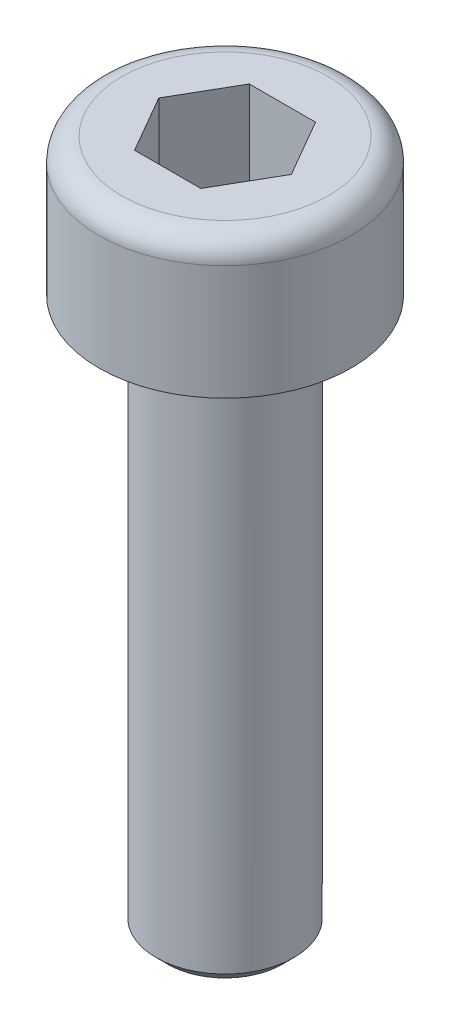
ISO-10303-21;
HEADER;
FILE_DESCRIPTION(('STEP AP214'),'2;1');
FILE_NAME('part.step','',(''),(''),'','','');
FILE_SCHEMA(('AUTOMOTIVE_DESIGN { 1 0 10303 214 1 1 1 1 }'));
ENDSEC;
DATA;
#1=APPLICATION_CONTEXT('core data for automotive mechanical design processes');
#2=APPLICATION_PROTOCOL_DEFINITION('international standard','automotive_design',2000,#1);
#3=PRODUCT_CONTEXT('',#1,'mechanical');
#4=PRODUCT('Part','Part','',(#3));
#5=PRODUCT_RELATED_PRODUCT_CATEGORY('part','',(#4));
#6=PRODUCT_DEFINITION_FORMATION('','',#4);
#7=PRODUCT_DEFINITION_CONTEXT('part definition',#1,'design');
#8=PRODUCT_DEFINITION('design','',#6,#7);
#9=PRODUCT_DEFINITION_SHAPE('','',#8);
#10=(LENGTH_UNIT() NAMED_UNIT(*) SI_UNIT(.MILLI.,.METRE.));
#11=(NAMED_UNIT(*) PLANE_ANGLE_UNIT() SI_UNIT($,.RADIAN.));
#12=(NAMED_UNIT(*) SI_UNIT($,.STERADIAN.) SOLID_ANGLE_UNIT());
#13=UNCERTAINTY_MEASURE_WITH_UNIT(LENGTH_MEASURE(1.E-05),#10,'distance_accuracy_value','');
#14=(GEOMETRIC_REPRESENTATION_CONTEXT(3) GLOBAL_UNCERTAINTY_ASSIGNED_CONTEXT((#13)) GLOBAL_UNIT_ASSIGNED_CONTEXT((#10,
#11,#12)) REPRESENTATION_CONTEXT('',''));
#15=CARTESIAN_POINT('',(0.,0.,0.));
#16=DIRECTION('',(0.,0.,1.));
#17=DIRECTION('',(1.,0.,0.));
#18=AXIS2_PLACEMENT_3D('',#15,#16,#17);
#19=CARTESIAN_POINT('',(0.,15.,0.));
#20=DIRECTION('',(0.,1.,0.));
#21=DIRECTION('',(0.,0.,1.));
#22=AXIS2_PLACEMENT_3D('',#19,#20,#21);
#23=PLANE('',#22);
#24=CARTESIAN_POINT('',(0.,15.,0.));
#25=DIRECTION('',(0.,1.,0.));
#26=DIRECTION('',(0.,0.,1.));
#27=AXIS2_PLACEMENT_3D('',#24,#25,#26);
#28=CIRCLE('',#27,2.25);
#29=CARTESIAN_POINT('',(0.,15.,2.25));
#30=VERTEX_POINT('',#29);
#31=EDGE_CURVE('E97',#30,#30,#28,.T.);
#32=ORIENTED_EDGE('',*,*,#31,.T.);
#33=EDGE_LOOP('',(#32));
#34=FACE_BOUND('',#33,.T.);
#35=DIRECTION('',(0.500000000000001,0.,-0.866025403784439));
#36=VECTOR('',#35,1.);
#37=CARTESIAN_POINT('',(-1.44337567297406,15.,0.));
#38=LINE('',#37,#36);
#39=CARTESIAN_POINT('',(-1.44337567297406,15.,0.));
#40=VERTEX_POINT('',#39);
#41=CARTESIAN_POINT('',(-0.721687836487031,15.,-1.24999999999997));
#42=VERTEX_POINT('',#41);
#43=EDGE_CURVE('E102',#40,#42,#38,.T.);
#44=ORIENTED_EDGE('',*,*,#43,.T.);
#45=DIRECTION('',(1.,0.,0.));
#46=VECTOR('',#45,1.);
#47=CARTESIAN_POINT('',(-0.721687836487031,15.,-1.24999999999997));
#48=LINE('',#47,#46);
#49=CARTESIAN_POINT('',(0.721687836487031,15.,-1.24999999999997));
#50=VERTEX_POINT('',#49);
#51=EDGE_CURVE('E43',#42,#50,#48,.T.);
#52=ORIENTED_EDGE('',*,*,#51,.T.);
#53=DIRECTION('',(0.5,0.,0.866025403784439));
#54=VECTOR('',#53,1.);
#55=CARTESIAN_POINT('',(0.721687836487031,15.,-1.24999999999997));
#56=LINE('',#55,#54);
#57=CARTESIAN_POINT('',(1.44337567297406,15.,0.));
#58=VERTEX_POINT('',#57);
#59=EDGE_CURVE('E83',#50,#58,#56,.T.);
#60=ORIENTED_EDGE('',*,*,#59,.T.);
#61=DIRECTION('',(-0.500000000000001,0.,0.866025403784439));
#62=VECTOR('',#61,1.);
#63=CARTESIAN_POINT('',(1.44337567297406,15.,0.));
#64=LINE('',#63,#62);
#65=CARTESIAN_POINT('',(0.721687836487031,15.,1.24999999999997));
#66=VERTEX_POINT('',#65);
#67=EDGE_CURVE('E91',#58,#66,#64,.T.);
#68=ORIENTED_EDGE('',*,*,#67,.T.);
#69=DIRECTION('',(-1.,0.,0.));
#70=VECTOR('',#69,1.);
#71=CARTESIAN_POINT('',(0.721687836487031,15.,1.24999999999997));
#72=LINE('',#71,#70);
#73=CARTESIAN_POINT('',(-0.721687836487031,15.,1.24999999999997));
#74=VERTEX_POINT('',#73);
#75=EDGE_CURVE('E106',#66,#74,#72,.T.);
#76=ORIENTED_EDGE('',*,*,#75,.T.);
#77=DIRECTION('',(-0.5,0.,-0.866025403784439));
#78=VECTOR('',#77,1.);
#79=CARTESIAN_POINT('',(-0.721687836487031,15.,1.24999999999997));
#80=LINE('',#79,#78);
#81=EDGE_CURVE('E109',#74,#40,#80,.T.);
#82=ORIENTED_EDGE('',*,*,#81,.T.);
#83=EDGE_LOOP('',(#44,#52,#60,#68,#76,#82));
#84=FACE_BOUND('',#83,.T.);
#85=ADVANCED_FACE('F28',(#34,#84),#23,.T.);
#86=CARTESIAN_POINT('',(-1.49999999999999,0.,0.));
#87=DIRECTION('',(0.,-1.,0.));
#88=DIRECTION('',(0.,0.,-1.));
#89=AXIS2_PLACEMENT_3D('',#86,#87,#88);
#90=PLANE('',#89);
#91=CARTESIAN_POINT('',(0.,0.,0.));
#92=DIRECTION('',(0.,-1.,0.));
#93=DIRECTION('',(0.,0.,-1.));
#94=AXIS2_PLACEMENT_3D('',#91,#92,#93);
#95=CIRCLE('',#94,1.24999999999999);
#96=CARTESIAN_POINT('',(0.,0.,-1.24999999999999));
#97=VERTEX_POINT('',#96);
#98=EDGE_CURVE('E11',#97,#97,#95,.T.);
#99=ORIENTED_EDGE('',*,*,#98,.T.);
#100=EDGE_LOOP('',(#99));
#101=FACE_BOUND('',#100,.T.);
#102=ADVANCED_FACE('F30',(#101),#90,.T.);
#103=CARTESIAN_POINT('',(0.,16.0880484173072,0.));
#104=DIRECTION('',(0.,1.,0.));
#105=DIRECTION('',(0.,0.,1.));
#106=AXIS2_PLACEMENT_3D('',#103,#104,#105);
#107=CYLINDRICAL_SURFACE('',#106,1.49999999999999);
#108=CARTESIAN_POINT('',(0.,0.25,0.));
#109=DIRECTION('',(0.,-1.,0.));
#110=DIRECTION('',(0.,0.,-1.));
#111=AXIS2_PLACEMENT_3D('',#108,#109,#110);
#112=CIRCLE('',#111,1.49999999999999);
#113=CARTESIAN_POINT('',(0.,0.25,-1.49999999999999));
#114=VERTEX_POINT('',#113);
#115=EDGE_CURVE('E36',#114,#114,#112,.F.);
#116=ORIENTED_EDGE('',*,*,#115,.T.);
#117=EDGE_LOOP('',(#116));
#118=FACE_BOUND('',#117,.T.);
#119=CARTESIAN_POINT('',(0.,12.,0.));
#120=DIRECTION('',(0.,1.,0.));
#121=DIRECTION('',(0.,0.,1.));
#122=AXIS2_PLACEMENT_3D('',#119,#120,#121);
#123=CIRCLE('',#122,1.49999999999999);
#124=CARTESIAN_POINT('',(0.,12.,1.49999999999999));
#125=VERTEX_POINT('',#124);
#126=EDGE_CURVE('E139',#125,#125,#123,.T.);
#127=ORIENTED_EDGE('',*,*,#126,.F.);
#128=EDGE_LOOP('',(#127));
#129=FACE_BOUND('',#128,.T.);
#130=ADVANCED_FACE('F144',(#118,#129),#107,.T.);
#131=CARTESIAN_POINT('',(-2.75,12.,0.));
#132=DIRECTION('',(0.,-1.,0.));
#133=DIRECTION('',(0.,0.,-1.));
#134=AXIS2_PLACEMENT_3D('',#131,#132,#133);
#135=PLANE('',#134);
#136=ORIENTED_EDGE('',*,*,#126,.T.);
#137=EDGE_LOOP('',(#136));
#138=FACE_BOUND('',#137,.T.);
#139=CARTESIAN_POINT('',(0.,12.,0.));
#140=DIRECTION('',(0.,1.,0.));
#141=DIRECTION('',(0.,0.,1.));
#142=AXIS2_PLACEMENT_3D('',#139,#140,#141);
#143=CIRCLE('',#142,2.74999999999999);
#144=CARTESIAN_POINT('',(0.,12.,2.74999999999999));
#145=VERTEX_POINT('',#144);
#146=EDGE_CURVE('E136',#145,#145,#143,.T.);
#147=ORIENTED_EDGE('',*,*,#146,.F.);
#148=EDGE_LOOP('',(#147));
#149=FACE_BOUND('',#148,.T.);
#150=ADVANCED_FACE('F176',(#138,#149),#135,.T.);
#151=CARTESIAN_POINT('',(0.,16.0880484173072,0.));
#152=DIRECTION('',(0.,1.,0.));
#153=DIRECTION('',(0.,0.,1.));
#154=AXIS2_PLACEMENT_3D('',#151,#152,#153);
#155=CYLINDRICAL_SURFACE('',#154,2.75);
#156=ORIENTED_EDGE('',*,*,#146,.T.);
#157=EDGE_LOOP('',(#156));
#158=FACE_BOUND('',#157,.T.);
#159=CARTESIAN_POINT('',(0.,14.5,0.));
#160=DIRECTION('',(0.,1.,0.));
#161=DIRECTION('',(0.,0.,1.));
#162=AXIS2_PLACEMENT_3D('',#159,#160,#161);
#163=CIRCLE('',#162,2.75);
#164=CARTESIAN_POINT('',(0.,14.5,2.75));
#165=VERTEX_POINT('',#164);
#166=EDGE_CURVE('E133',#165,#165,#163,.T.);
#167=ORIENTED_EDGE('',*,*,#166,.F.);
#168=EDGE_LOOP('',(#167));
#169=FACE_BOUND('',#168,.T.);
#170=ADVANCED_FACE('F172',(#158,#169),#155,.T.);
#171=CARTESIAN_POINT('',(0.,14.5,0.));
#172=DIRECTION('',(0.,1.,0.));
#173=DIRECTION('',(0.,0.,1.));
#174=AXIS2_PLACEMENT_3D('',#171,#172,#173);
#175=TOROIDAL_SURFACE('',#174,2.25,0.500000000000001);
#176=ORIENTED_EDGE('',*,*,#31,.F.);
#177=EDGE_LOOP('',(#176));
#178=FACE_BOUND('',#177,.T.);
#179=ORIENTED_EDGE('',*,*,#166,.T.);
#180=EDGE_LOOP('',(#179));
#181=FACE_BOUND('',#180,.T.);
#182=ADVANCED_FACE('F169',(#178,#181),#175,.T.);
#183=CARTESIAN_POINT('',(-0.721687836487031,13.,-1.24999999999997));
#184=DIRECTION('',(0.,0.,1.));
#185=DIRECTION('',(1.,0.,0.));
#186=AXIS2_PLACEMENT_3D('',#183,#184,#185);
#187=PLANE('',#186);
#188=ORIENTED_EDGE('',*,*,#51,.F.);
#189=DIRECTION('',(0.,1.,0.));
#190=VECTOR('',#189,1.);
#191=CARTESIAN_POINT('',(-0.721687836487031,13.,-1.24999999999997));
#192=LINE('',#191,#190);
#193=CARTESIAN_POINT('',(-0.721687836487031,13.,-1.24999999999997));
#194=VERTEX_POINT('',#193);
#195=EDGE_CURVE('E122',#194,#42,#192,.T.);
#196=ORIENTED_EDGE('',*,*,#195,.F.);
#197=DIRECTION('',(1.,0.,0.));
#198=VECTOR('',#197,1.);
#199=CARTESIAN_POINT('',(-0.721687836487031,13.,-1.24999999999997));
#200=LINE('',#199,#198);
#201=CARTESIAN_POINT('',(0.721687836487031,13.,-1.24999999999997));
#202=VERTEX_POINT('',#201);
#203=EDGE_CURVE('E96',#194,#202,#200,.T.);
#204=ORIENTED_EDGE('',*,*,#203,.T.);
#205=DIRECTION('',(0.,1.,0.));
#206=VECTOR('',#205,1.);
#207=CARTESIAN_POINT('',(0.721687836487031,13.,-1.24999999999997));
#208=LINE('',#207,#206);
#209=EDGE_CURVE('E85',#202,#50,#208,.T.);
#210=ORIENTED_EDGE('',*,*,#209,.T.);
#211=EDGE_LOOP('',(#188,#196,#204,#210));
#212=FACE_BOUND('',#211,.T.);
#213=ADVANCED_FACE('F94',(#212),#187,.T.);
#214=CARTESIAN_POINT('',(0.721687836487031,13.,-1.24999999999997));
#215=DIRECTION('',(-0.866025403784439,0.,0.500000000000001));
#216=DIRECTION('',(0.5,0.,0.866025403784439));
#217=AXIS2_PLACEMENT_3D('',#214,#215,#216);
#218=PLANE('',#217);
#219=ORIENTED_EDGE('',*,*,#59,.F.);
#220=ORIENTED_EDGE('',*,*,#209,.F.);
#221=DIRECTION('',(0.5,0.,0.866025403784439));
#222=VECTOR('',#221,1.);
#223=CARTESIAN_POINT('',(0.721687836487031,13.,-1.24999999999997));
#224=LINE('',#223,#222);
#225=CARTESIAN_POINT('',(1.44337567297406,13.,0.));
#226=VERTEX_POINT('',#225);
#227=EDGE_CURVE('E113',#202,#226,#224,.T.);
#228=ORIENTED_EDGE('',*,*,#227,.T.);
#229=DIRECTION('',(0.,1.,0.));
#230=VECTOR('',#229,1.);
#231=CARTESIAN_POINT('',(1.44337567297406,13.,0.));
#232=LINE('',#231,#230);
#233=EDGE_CURVE('E87',#226,#58,#232,.T.);
#234=ORIENTED_EDGE('',*,*,#233,.T.);
#235=EDGE_LOOP('',(#219,#220,#228,#234));
#236=FACE_BOUND('',#235,.T.);
#237=ADVANCED_FACE('F84',(#236),#218,.T.);
#238=CARTESIAN_POINT('',(1.44337567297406,13.,0.));
#239=DIRECTION('',(-0.866025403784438,0.,-0.5));
#240=DIRECTION('',(-0.500000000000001,0.,0.866025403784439));
#241=AXIS2_PLACEMENT_3D('',#238,#239,#240);
#242=PLANE('',#241);
#243=ORIENTED_EDGE('',*,*,#67,.F.);
#244=ORIENTED_EDGE('',*,*,#233,.F.);
#245=DIRECTION('',(-0.500000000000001,0.,0.866025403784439));
#246=VECTOR('',#245,1.);
#247=CARTESIAN_POINT('',(1.44337567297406,13.,0.));
#248=LINE('',#247,#246);
#249=CARTESIAN_POINT('',(0.721687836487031,13.,1.24999999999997));
#250=VERTEX_POINT('',#249);
#251=EDGE_CURVE('E115',#226,#250,#248,.T.);
#252=ORIENTED_EDGE('',*,*,#251,.T.);
#253=DIRECTION('',(0.,1.,0.));
#254=VECTOR('',#253,1.);
#255=CARTESIAN_POINT('',(0.721687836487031,13.,1.24999999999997));
#256=LINE('',#255,#254);
#257=EDGE_CURVE('E128',#250,#66,#256,.T.);
#258=ORIENTED_EDGE('',*,*,#257,.T.);
#259=EDGE_LOOP('',(#243,#244,#252,#258));
#260=FACE_BOUND('',#259,.T.);
#261=ADVANCED_FACE('F208',(#260),#242,.T.);
#262=CARTESIAN_POINT('',(0.721687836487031,13.,1.24999999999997));
#263=DIRECTION('',(0.,0.,-1.));
#264=DIRECTION('',(-1.,0.,0.));
#265=AXIS2_PLACEMENT_3D('',#262,#263,#264);
#266=PLANE('',#265);
#267=ORIENTED_EDGE('',*,*,#75,.F.);
#268=ORIENTED_EDGE('',*,*,#257,.F.);
#269=DIRECTION('',(-1.,0.,0.));
#270=VECTOR('',#269,1.);
#271=CARTESIAN_POINT('',(0.721687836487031,13.,1.24999999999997));
#272=LINE('',#271,#270);
#273=CARTESIAN_POINT('',(-0.721687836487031,13.,1.24999999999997));
#274=VERTEX_POINT('',#273);
#275=EDGE_CURVE('E117',#250,#274,#272,.T.);
#276=ORIENTED_EDGE('',*,*,#275,.T.);
#277=DIRECTION('',(0.,1.,0.));
#278=VECTOR('',#277,1.);
#279=CARTESIAN_POINT('',(-0.721687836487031,13.,1.24999999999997));
#280=LINE('',#279,#278);
#281=EDGE_CURVE('E126',#274,#74,#280,.T.);
#282=ORIENTED_EDGE('',*,*,#281,.T.);
#283=EDGE_LOOP('',(#267,#268,#276,#282));
#284=FACE_BOUND('',#283,.T.);
#285=ADVANCED_FACE('F214',(#284),#266,.T.);
#286=CARTESIAN_POINT('',(-0.721687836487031,13.,1.24999999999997));
#287=DIRECTION('',(0.866025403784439,0.,-0.500000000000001));
#288=DIRECTION('',(-0.5,0.,-0.866025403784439));
#289=AXIS2_PLACEMENT_3D('',#286,#287,#288);
#290=PLANE('',#289);
#291=ORIENTED_EDGE('',*,*,#81,.F.);
#292=ORIENTED_EDGE('',*,*,#281,.F.);
#293=DIRECTION('',(-0.5,0.,-0.866025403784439));
#294=VECTOR('',#293,1.);
#295=CARTESIAN_POINT('',(-0.721687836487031,13.,1.24999999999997));
#296=LINE('',#295,#294);
#297=CARTESIAN_POINT('',(-1.44337567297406,13.,0.));
#298=VERTEX_POINT('',#297);
#299=EDGE_CURVE('E119',#274,#298,#296,.T.);
#300=ORIENTED_EDGE('',*,*,#299,.T.);
#301=DIRECTION('',(0.,1.,0.));
#302=VECTOR('',#301,1.);
#303=CARTESIAN_POINT('',(-1.44337567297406,13.,0.));
#304=LINE('',#303,#302);
#305=EDGE_CURVE('E124',#298,#40,#304,.T.);
#306=ORIENTED_EDGE('',*,*,#305,.T.);
#307=EDGE_LOOP('',(#291,#292,#300,#306));
#308=FACE_BOUND('',#307,.T.);
#309=ADVANCED_FACE('F222',(#308),#290,.T.);
#310=CARTESIAN_POINT('',(-1.44337567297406,13.,0.));
#311=DIRECTION('',(0.866025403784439,0.,0.5));
#312=DIRECTION('',(0.500000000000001,0.,-0.866025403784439));
#313=AXIS2_PLACEMENT_3D('',#310,#311,#312);
#314=PLANE('',#313);
#315=ORIENTED_EDGE('',*,*,#43,.F.);
#316=ORIENTED_EDGE('',*,*,#305,.F.);
#317=DIRECTION('',(0.500000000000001,0.,-0.866025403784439));
#318=VECTOR('',#317,1.);
#319=CARTESIAN_POINT('',(-1.44337567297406,13.,0.));
#320=LINE('',#319,#318);
#321=EDGE_CURVE('E50',#298,#194,#320,.T.);
#322=ORIENTED_EDGE('',*,*,#321,.T.);
#323=ORIENTED_EDGE('',*,*,#195,.T.);
#324=EDGE_LOOP('',(#315,#316,#322,#323));
#325=FACE_BOUND('',#324,.T.);
#326=ADVANCED_FACE('F155',(#325),#314,.T.);
#327=CARTESIAN_POINT('',(0.721687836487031,13.,-1.24999999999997));
#328=DIRECTION('',(0.,-1.,0.));
#329=DIRECTION('',(0.,0.,-1.));
#330=AXIS2_PLACEMENT_3D('',#327,#328,#329);
#331=PLANE('',#330);
#332=ORIENTED_EDGE('',*,*,#203,.F.);
#333=ORIENTED_EDGE('',*,*,#321,.F.);
#334=ORIENTED_EDGE('',*,*,#299,.F.);
#335=ORIENTED_EDGE('',*,*,#275,.F.);
#336=ORIENTED_EDGE('',*,*,#251,.F.);
#337=ORIENTED_EDGE('',*,*,#227,.F.);
#338=EDGE_LOOP('',(#332,#333,#334,#335,#336,#337));
#339=FACE_BOUND('',#338,.T.);
#340=ADVANCED_FACE('F149',(#339),#331,.F.);
#341=CARTESIAN_POINT('',(0.,0.25,0.));
#342=DIRECTION('',(0.,1.,0.));
#343=DIRECTION('',(0.,0.,1.));
#344=AXIS2_PLACEMENT_3D('',#341,#342,#343);
#345=CONICAL_SURFACE('',#344,1.49999999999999,0.785398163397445);
#346=ORIENTED_EDGE('',*,*,#98,.F.);
#347=EDGE_LOOP('',(#346));
#348=FACE_BOUND('',#347,.T.);
#349=ORIENTED_EDGE('',*,*,#115,.F.);
#350=EDGE_LOOP('',(#349));
#351=FACE_BOUND('',#350,.T.);
#352=ADVANCED_FACE('F147',(#348,#351),#345,.T.);
#353=CLOSED_SHELL('',(#85,#102,#130,#150,#170,#182,#213,#237,#261,#285,#309,#326,#340,#352));
#354=MANIFOLD_SOLID_BREP('B2',#353);
#355=ADVANCED_BREP_SHAPE_REPRESENTATION('',(#18,#354),#14);
#356=SHAPE_DEFINITION_REPRESENTATION(#9,#355);
ENDSEC;
END-ISO-10303-21;
